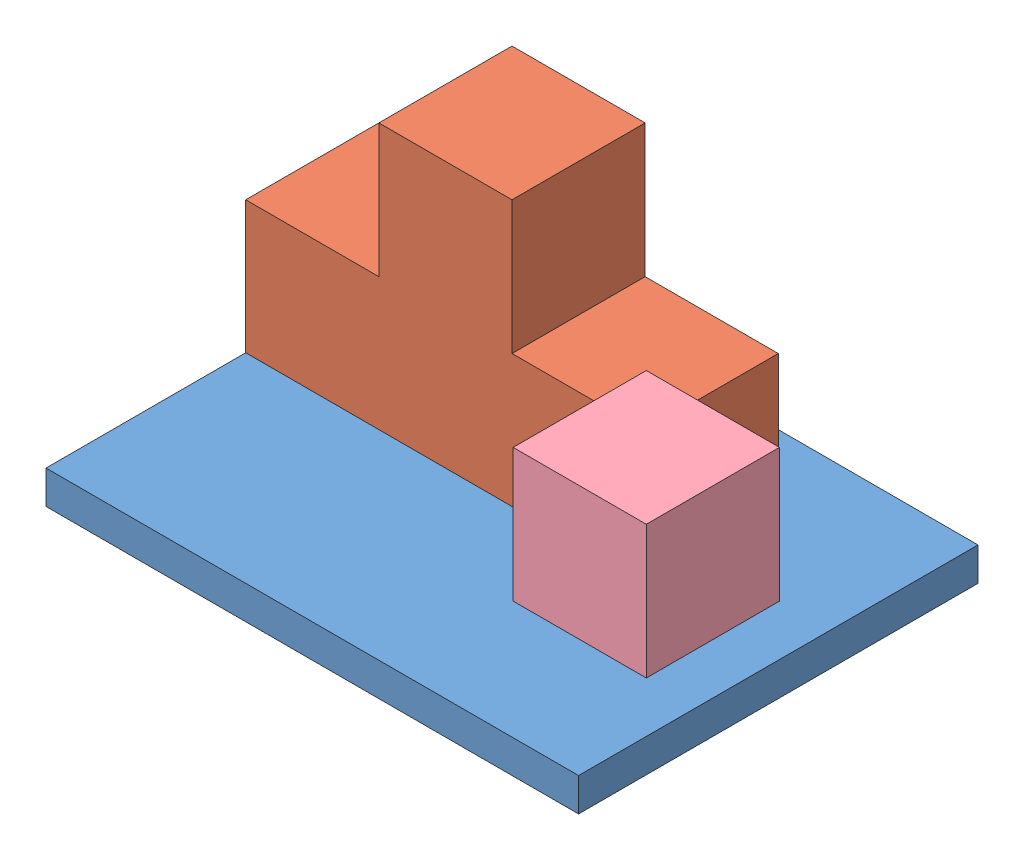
SolidWorks assembly Interference Detection.SLDASM, configuration Default (file format 4628). Lengths in mm.
Overall size (203.2 120.61 152.4).
5 component instances, 4 part files, 8 mates.
Components (placement in the parent):
- Base Plate-1: Base Plate.SLDPRT [Default] at origin size (203.2 12.7 152.4)
- T Block-1: T Block.SLDPRT [Default] at (76.2 12.446 50.8) size (152.4 101.6 50.8)
- Pan Cross Head_AI-3: Pan Cross Head_AI.SLDPRT [PreviewCfg] at (23.7272 -6.6294 51.6362) x (0 1 0) z (0.222746 0 0.974876) size (44.66 18.8 18.8)
- Pan Cross Head_AI-4: Pan Cross Head_AI.SLDPRT [PreviewCfg] at (127.1699 -6.6294 51.8919) x (0 1 0) z (0.050528 0 0.998723) size (44.66 18.8 18.8)
- Block-1: Block.SLDPRT [Default] at (158.4989 12.7 81.848) size (50.8 50.8 50.8)
Mates (geometry in assembly coordinates):
- Distance6: distance = 0.254 mm anti-aligned: plane of Base Plate-1 through (0 12.7 152.4) normal (0 1 0); plane of T Block-1 through (76.4923 12.446 76.2) normal (0 -1 0)
- Distance5: distance = 76.2 mm aligned: plane of T Block-1 through (76.4923 -113.4112 76.2) normal (0 0 1); plane of Base Plate-1 through (0 12.7 152.4) normal (0 0 1)
- Coincident34: coincident aligned: plane of Base Plate-1 through (0 0 152.4) normal (-1 0 0); plane of T Block-1 through (0 -113.4112 76.2) normal (-1 0 0)
- Coincident37: coincident: plane of Base Plate-1 through (0 0 152.4) normal (0 -1 0); plane of ? through (134.0801 0 101.0719) normal (0 1 0)
- Coincident38: coincident anti-aligned: plane of Base Plate-1 through (0 0 152.4) normal (0 -1 0); plane of Pan Cross Head_AI-3 through (19.0843 0 52.6971) normal (0 1 0)
- Coincident39: coincident anti-aligned: plane of Base Plate-1 through (0 0 152.4) normal (0 -1 0); plane of Pan Cross Head_AI-4 through (122.4135 0 52.1325) normal (0 1 0)
- Coincident40: coincident anti-aligned: plane of Base Plate-1 through (0 12.7 152.4) normal (0 1 0); plane of Block-1 through (133.0989 12.7 107.248) normal (0 -1 0)
- Parallel1: parallel aligned: plane of Base Plate-1 through (0 12.7 152.4) normal (0 0 1); plane of Block-1 through (133.0989 63.5 107.248) normal (0 0 1)
